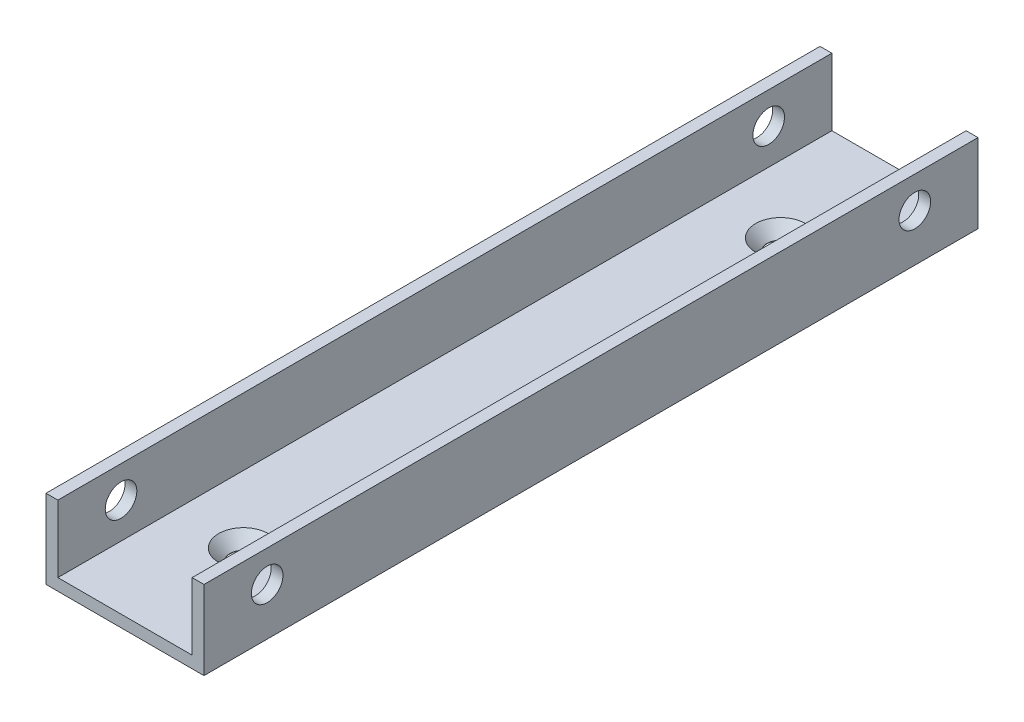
from build123d import *

# Parameters (mm, degrees)
EXTRUSION1_DEPTH                               = 98
FRAISAGE_POUR_VIS_T_TE_FRAIS_E_M31_D           = 3.4
FRAISAGE_POUR_VIS_T_TE_FRAIS_E_M31_DEPTH       = 10
FRAISAGE_POUR_VIS_T_TE_FRAIS_E_M31_CSINK_D     = 6.3
FRAISAGE_POUR_VIS_T_TE_FRAIS_E_M31_CSINK_ANGLE = 90
FRAISAGE_POUR_VIS_T_TE_FRAIS_E_M31_TIP         = 1.021463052
ESQUISSE4_R                                    = 2
ENL_V_MAT_EXTRU_1_DEPTH                        = 101.518654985


with BuildPart() as part:
    # Esquisse1 → Extrusion1 (new body)
    with BuildSketch(Plane.XY):
        Polygon((10, 0), (-10, 0), (-10, 10), (-8.5, 10), (-8.5, 1.5), (8.5, 1.5), (8.5, 10), (10, 10), align=None)
    extrude(amount=-EXTRUSION1_DEPTH)

    # Fraisage pour vis _ t_te frais_e M31
    with Locations(Plane(origin=(0, 1.5, -83), x_dir=(0, 0, 1), z_dir=(0, 1, 0))):
        with Locations((0, 0), (68, 0)):
            CounterSinkHole(FRAISAGE_POUR_VIS_T_TE_FRAIS_E_M31_D / 2, FRAISAGE_POUR_VIS_T_TE_FRAIS_E_M31_CSINK_D / 2, depth=FRAISAGE_POUR_VIS_T_TE_FRAIS_E_M31_DEPTH, counter_sink_angle=FRAISAGE_POUR_VIS_T_TE_FRAIS_E_M31_CSINK_ANGLE)
            with Locations((0, 0, -(FRAISAGE_POUR_VIS_T_TE_FRAIS_E_M31_DEPTH + FRAISAGE_POUR_VIS_T_TE_FRAIS_E_M31_TIP / 2))):  # 118° drill point
                Cone(0, FRAISAGE_POUR_VIS_T_TE_FRAIS_E_M31_D / 2, FRAISAGE_POUR_VIS_T_TE_FRAIS_E_M31_TIP, mode=Mode.SUBTRACT)

    # Esquisse4 → Enl_v. mat.-Extru.1 (cut, through all)
    with BuildSketch(Plane.ZY.offset(10)):
        with Locations((-8, 6)):
            Circle(ESQUISSE4_R)
        with Locations((-90, 6)):
            Circle(ESQUISSE4_R)
    extrude(amount=-ENL_V_MAT_EXTRU_1_DEPTH, mode=Mode.SUBTRACT)


solid = part.part
